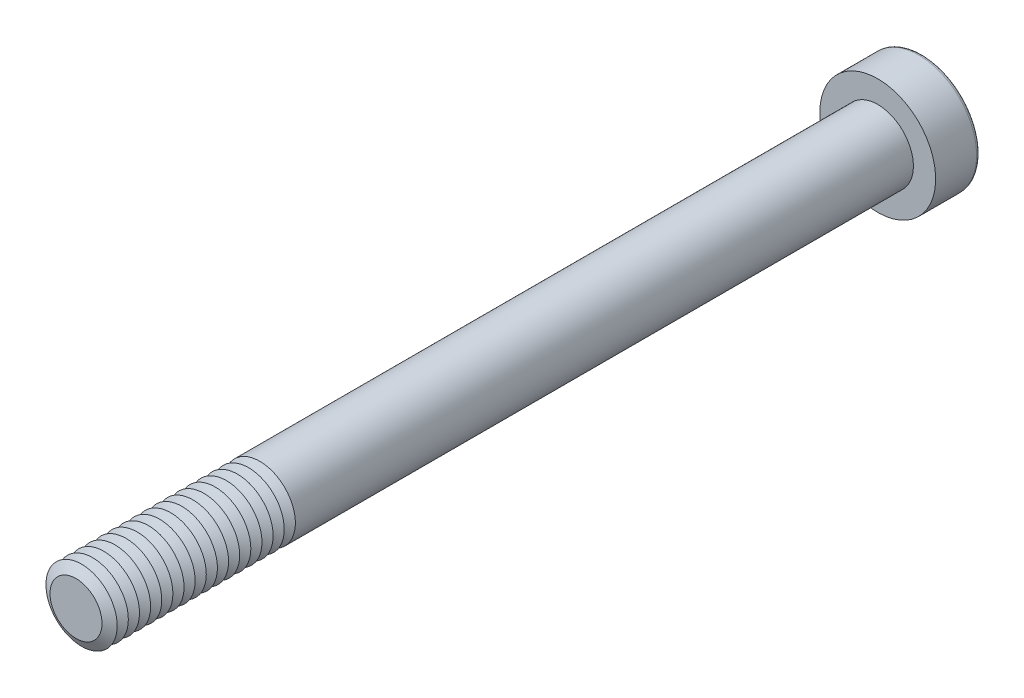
ISO-10303-21;
HEADER;
FILE_DESCRIPTION(('STEP AP214'),'2;1');
FILE_NAME('part.step','',(''),(''),'','','');
FILE_SCHEMA(('AUTOMOTIVE_DESIGN { 1 0 10303 214 1 1 1 1 }'));
ENDSEC;
DATA;
#1=APPLICATION_CONTEXT('core data for automotive mechanical design processes');
#2=APPLICATION_PROTOCOL_DEFINITION('international standard','automotive_design',2000,#1);
#3=PRODUCT_CONTEXT('',#1,'mechanical');
#4=PRODUCT('Part','Part','',(#3));
#5=PRODUCT_RELATED_PRODUCT_CATEGORY('part','',(#4));
#6=PRODUCT_DEFINITION_FORMATION('','',#4);
#7=PRODUCT_DEFINITION_CONTEXT('part definition',#1,'design');
#8=PRODUCT_DEFINITION('design','',#6,#7);
#9=PRODUCT_DEFINITION_SHAPE('','',#8);
#10=(LENGTH_UNIT() NAMED_UNIT(*) SI_UNIT(.MILLI.,.METRE.));
#11=(NAMED_UNIT(*) PLANE_ANGLE_UNIT() SI_UNIT($,.RADIAN.));
#12=(NAMED_UNIT(*) SI_UNIT($,.STERADIAN.) SOLID_ANGLE_UNIT());
#13=UNCERTAINTY_MEASURE_WITH_UNIT(LENGTH_MEASURE(1.E-05),#10,'distance_accuracy_value','');
#14=(GEOMETRIC_REPRESENTATION_CONTEXT(3) GLOBAL_UNCERTAINTY_ASSIGNED_CONTEXT((#13)) GLOBAL_UNIT_ASSIGNED_CONTEXT((#10,
#11,#12)) REPRESENTATION_CONTEXT('',''));
#15=CARTESIAN_POINT('',(0.,0.,0.));
#16=DIRECTION('',(0.,0.,1.));
#17=DIRECTION('',(1.,0.,0.));
#18=AXIS2_PLACEMENT_3D('',#15,#16,#17);
#19=CARTESIAN_POINT('',(0.,0.,85.625));
#20=DIRECTION('',(0.,0.,1.));
#21=DIRECTION('',(1.,0.,0.));
#22=AXIS2_PLACEMENT_3D('',#19,#20,#21);
#23=CONICAL_SURFACE('',#22,4.,1.0471975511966);
#24=CARTESIAN_POINT('',(0.,0.,85.));
#25=DIRECTION('',(0.,0.,1.));
#26=DIRECTION('',(1.,0.,0.));
#27=AXIS2_PLACEMENT_3D('',#24,#25,#26);
#28=CIRCLE('',#27,2.91746824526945);
#29=CARTESIAN_POINT('',(2.91746824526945,0.,85.));
#30=VERTEX_POINT('',#29);
#31=EDGE_CURVE('E312',#30,#30,#28,.T.);
#32=ORIENTED_EDGE('',*,*,#31,.T.);
#33=EDGE_LOOP('',(#32));
#34=FACE_BOUND('',#33,.T.);
#35=CARTESIAN_POINT('',(0.,0.,85.625));
#36=DIRECTION('',(0.,0.,1.));
#37=DIRECTION('',(1.,0.,0.));
#38=AXIS2_PLACEMENT_3D('',#35,#36,#37);
#39=CIRCLE('',#38,4.);
#40=CARTESIAN_POINT('',(4.,0.,85.625));
#41=VERTEX_POINT('',#40);
#42=EDGE_CURVE('E315',#41,#41,#39,.T.);
#43=ORIENTED_EDGE('',*,*,#42,.F.);
#44=EDGE_LOOP('',(#43));
#45=FACE_BOUND('',#44,.T.);
#46=ADVANCED_FACE('F39',(#34,#45),#23,.T.);
#47=CARTESIAN_POINT('',(0.,0.,85.));
#48=DIRECTION('',(0.,0.,-1.));
#49=DIRECTION('',(-1.,0.,0.));
#50=AXIS2_PLACEMENT_3D('',#47,#48,#49);
#51=CONICAL_SURFACE('',#50,2.91746824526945,1.0471975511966);
#52=CARTESIAN_POINT('',(0.,0.,84.375));
#53=DIRECTION('',(0.,0.,1.));
#54=DIRECTION('',(1.,0.,0.));
#55=AXIS2_PLACEMENT_3D('',#52,#53,#54);
#56=CIRCLE('',#55,4.);
#57=CARTESIAN_POINT('',(4.,0.,84.375));
#58=VERTEX_POINT('',#57);
#59=EDGE_CURVE('E323',#58,#58,#56,.T.);
#60=ORIENTED_EDGE('',*,*,#59,.T.);
#61=EDGE_LOOP('',(#60));
#62=FACE_BOUND('',#61,.T.);
#63=ORIENTED_EDGE('',*,*,#31,.F.);
#64=EDGE_LOOP('',(#63));
#65=FACE_BOUND('',#64,.T.);
#66=ADVANCED_FACE('F245',(#62,#65),#51,.T.);
#67=CARTESIAN_POINT('',(0.,0.,90.));
#68=DIRECTION('',(0.,0.,1.));
#69=DIRECTION('',(1.,0.,0.));
#70=AXIS2_PLACEMENT_3D('',#67,#68,#69);
#71=PLANE('',#70);
#72=CARTESIAN_POINT('',(0.,0.,90.));
#73=DIRECTION('',(0.,0.,1.));
#74=DIRECTION('',(1.,0.,0.));
#75=AXIS2_PLACEMENT_3D('',#72,#73,#74);
#76=CIRCLE('',#75,2.91746824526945);
#77=CARTESIAN_POINT('',(2.91746824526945,0.,90.));
#78=VERTEX_POINT('',#77);
#79=EDGE_CURVE('E174',#78,#78,#76,.T.);
#80=ORIENTED_EDGE('',*,*,#79,.T.);
#81=EDGE_LOOP('',(#80));
#82=FACE_BOUND('',#81,.T.);
#83=ADVANCED_FACE('F251',(#82),#71,.T.);
#84=CARTESIAN_POINT('',(0.,0.,90.));
#85=DIRECTION('',(0.,0.,-1.));
#86=DIRECTION('',(-1.,0.,0.));
#87=AXIS2_PLACEMENT_3D('',#84,#85,#86);
#88=CONICAL_SURFACE('',#87,2.91746824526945,1.0471975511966);
#89=CARTESIAN_POINT('',(0.,0.,89.375));
#90=DIRECTION('',(0.,0.,1.));
#91=DIRECTION('',(1.,0.,0.));
#92=AXIS2_PLACEMENT_3D('',#89,#90,#91);
#93=CIRCLE('',#92,4.);
#94=CARTESIAN_POINT('',(4.,0.,89.375));
#95=VERTEX_POINT('',#94);
#96=EDGE_CURVE('E291',#95,#95,#93,.T.);
#97=ORIENTED_EDGE('',*,*,#96,.T.);
#98=EDGE_LOOP('',(#97));
#99=FACE_BOUND('',#98,.T.);
#100=ORIENTED_EDGE('',*,*,#79,.F.);
#101=EDGE_LOOP('',(#100));
#102=FACE_BOUND('',#101,.T.);
#103=ADVANCED_FACE('F199',(#99,#102),#88,.T.);
#104=CARTESIAN_POINT('',(0.,0.,89.375));
#105=DIRECTION('',(0.,0.,1.));
#106=DIRECTION('',(1.,0.,0.));
#107=AXIS2_PLACEMENT_3D('',#104,#105,#106);
#108=CONICAL_SURFACE('',#107,4.,1.0471975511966);
#109=CARTESIAN_POINT('',(0.,0.,88.75));
#110=DIRECTION('',(0.,0.,1.));
#111=DIRECTION('',(1.,0.,0.));
#112=AXIS2_PLACEMENT_3D('',#109,#110,#111);
#113=CIRCLE('',#112,2.91746824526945);
#114=CARTESIAN_POINT('',(2.91746824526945,0.,88.75));
#115=VERTEX_POINT('',#114);
#116=EDGE_CURVE('E288',#115,#115,#113,.T.);
#117=ORIENTED_EDGE('',*,*,#116,.T.);
#118=EDGE_LOOP('',(#117));
#119=FACE_BOUND('',#118,.T.);
#120=ORIENTED_EDGE('',*,*,#96,.F.);
#121=EDGE_LOOP('',(#120));
#122=FACE_BOUND('',#121,.T.);
#123=ADVANCED_FACE('F277',(#119,#122),#108,.T.);
#124=CARTESIAN_POINT('',(0.,0.,88.75));
#125=DIRECTION('',(0.,0.,-1.));
#126=DIRECTION('',(-1.,0.,0.));
#127=AXIS2_PLACEMENT_3D('',#124,#125,#126);
#128=CONICAL_SURFACE('',#127,2.91746824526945,1.0471975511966);
#129=CARTESIAN_POINT('',(0.,0.,88.125));
#130=DIRECTION('',(0.,0.,1.));
#131=DIRECTION('',(1.,0.,0.));
#132=AXIS2_PLACEMENT_3D('',#129,#130,#131);
#133=CIRCLE('',#132,4.);
#134=CARTESIAN_POINT('',(4.,0.,88.125));
#135=VERTEX_POINT('',#134);
#136=EDGE_CURVE('E299',#135,#135,#133,.T.);
#137=ORIENTED_EDGE('',*,*,#136,.T.);
#138=EDGE_LOOP('',(#137));
#139=FACE_BOUND('',#138,.T.);
#140=ORIENTED_EDGE('',*,*,#116,.F.);
#141=EDGE_LOOP('',(#140));
#142=FACE_BOUND('',#141,.T.);
#143=ADVANCED_FACE('F274',(#139,#142),#128,.T.);
#144=CARTESIAN_POINT('',(0.,0.,88.125));
#145=DIRECTION('',(0.,0.,1.));
#146=DIRECTION('',(1.,0.,0.));
#147=AXIS2_PLACEMENT_3D('',#144,#145,#146);
#148=CONICAL_SURFACE('',#147,4.,1.0471975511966);
#149=CARTESIAN_POINT('',(0.,0.,87.5));
#150=DIRECTION('',(0.,0.,1.));
#151=DIRECTION('',(1.,0.,0.));
#152=AXIS2_PLACEMENT_3D('',#149,#150,#151);
#153=CIRCLE('',#152,2.91746824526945);
#154=CARTESIAN_POINT('',(2.91746824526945,0.,87.5));
#155=VERTEX_POINT('',#154);
#156=EDGE_CURVE('E293',#155,#155,#153,.T.);
#157=ORIENTED_EDGE('',*,*,#156,.T.);
#158=EDGE_LOOP('',(#157));
#159=FACE_BOUND('',#158,.T.);
#160=ORIENTED_EDGE('',*,*,#136,.F.);
#161=EDGE_LOOP('',(#160));
#162=FACE_BOUND('',#161,.T.);
#163=ADVANCED_FACE('F270',(#159,#162),#148,.T.);
#164=CARTESIAN_POINT('',(0.,0.,87.5));
#165=DIRECTION('',(0.,0.,-1.));
#166=DIRECTION('',(-1.,0.,0.));
#167=AXIS2_PLACEMENT_3D('',#164,#165,#166);
#168=CONICAL_SURFACE('',#167,2.91746824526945,1.0471975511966);
#169=CARTESIAN_POINT('',(0.,0.,86.875));
#170=DIRECTION('',(0.,0.,1.));
#171=DIRECTION('',(1.,0.,0.));
#172=AXIS2_PLACEMENT_3D('',#169,#170,#171);
#173=CIRCLE('',#172,4.);
#174=CARTESIAN_POINT('',(4.,0.,86.875));
#175=VERTEX_POINT('',#174);
#176=EDGE_CURVE('E309',#175,#175,#173,.T.);
#177=ORIENTED_EDGE('',*,*,#176,.T.);
#178=EDGE_LOOP('',(#177));
#179=FACE_BOUND('',#178,.T.);
#180=ORIENTED_EDGE('',*,*,#156,.F.);
#181=EDGE_LOOP('',(#180));
#182=FACE_BOUND('',#181,.T.);
#183=ADVANCED_FACE('F266',(#179,#182),#168,.T.);
#184=CARTESIAN_POINT('',(0.,0.,86.875));
#185=DIRECTION('',(0.,0.,1.));
#186=DIRECTION('',(1.,0.,0.));
#187=AXIS2_PLACEMENT_3D('',#184,#185,#186);
#188=CONICAL_SURFACE('',#187,4.,1.0471975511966);
#189=CARTESIAN_POINT('',(0.,0.,86.25));
#190=DIRECTION('',(0.,0.,1.));
#191=DIRECTION('',(1.,0.,0.));
#192=AXIS2_PLACEMENT_3D('',#189,#190,#191);
#193=CIRCLE('',#192,2.91746824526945);
#194=CARTESIAN_POINT('',(2.91746824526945,0.,86.25));
#195=VERTEX_POINT('',#194);
#196=EDGE_CURVE('E305',#195,#195,#193,.T.);
#197=ORIENTED_EDGE('',*,*,#196,.T.);
#198=EDGE_LOOP('',(#197));
#199=FACE_BOUND('',#198,.T.);
#200=ORIENTED_EDGE('',*,*,#176,.F.);
#201=EDGE_LOOP('',(#200));
#202=FACE_BOUND('',#201,.T.);
#203=ADVANCED_FACE('F262',(#199,#202),#188,.T.);
#204=CARTESIAN_POINT('',(0.,0.,86.25));
#205=DIRECTION('',(0.,0.,-1.));
#206=DIRECTION('',(-1.,0.,0.));
#207=AXIS2_PLACEMENT_3D('',#204,#205,#206);
#208=CONICAL_SURFACE('',#207,2.91746824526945,1.0471975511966);
#209=ORIENTED_EDGE('',*,*,#42,.T.);
#210=EDGE_LOOP('',(#209));
#211=FACE_BOUND('',#210,.T.);
#212=ORIENTED_EDGE('',*,*,#196,.F.);
#213=EDGE_LOOP('',(#212));
#214=FACE_BOUND('',#213,.T.);
#215=ADVANCED_FACE('F258',(#211,#214),#208,.T.);
#216=CARTESIAN_POINT('',(0.,0.,84.375));
#217=DIRECTION('',(0.,0.,1.));
#218=DIRECTION('',(1.,0.,0.));
#219=AXIS2_PLACEMENT_3D('',#216,#217,#218);
#220=CONICAL_SURFACE('',#219,4.,1.0471975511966);
#221=CARTESIAN_POINT('',(0.,0.,83.75));
#222=DIRECTION('',(0.,0.,1.));
#223=DIRECTION('',(1.,0.,0.));
#224=AXIS2_PLACEMENT_3D('',#221,#222,#223);
#225=CIRCLE('',#224,2.91746824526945);
#226=CARTESIAN_POINT('',(2.91746824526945,0.,83.75));
#227=VERTEX_POINT('',#226);
#228=EDGE_CURVE('E319',#227,#227,#225,.T.);
#229=ORIENTED_EDGE('',*,*,#228,.T.);
#230=EDGE_LOOP('',(#229));
#231=FACE_BOUND('',#230,.T.);
#232=ORIENTED_EDGE('',*,*,#59,.F.);
#233=EDGE_LOOP('',(#232));
#234=FACE_BOUND('',#233,.T.);
#235=ADVANCED_FACE('F261',(#231,#234),#220,.T.);
#236=CARTESIAN_POINT('',(0.,0.,83.75));
#237=DIRECTION('',(0.,0.,-1.));
#238=DIRECTION('',(-1.,0.,0.));
#239=AXIS2_PLACEMENT_3D('',#236,#237,#238);
#240=CONICAL_SURFACE('',#239,2.91746824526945,1.0471975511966);
#241=CARTESIAN_POINT('',(0.,0.,83.125));
#242=DIRECTION('',(0.,0.,1.));
#243=DIRECTION('',(1.,0.,0.));
#244=AXIS2_PLACEMENT_3D('',#241,#242,#243);
#245=CIRCLE('',#244,4.);
#246=CARTESIAN_POINT('',(4.,0.,83.125));
#247=VERTEX_POINT('',#246);
#248=EDGE_CURVE('E331',#247,#247,#245,.T.);
#249=ORIENTED_EDGE('',*,*,#248,.T.);
#250=EDGE_LOOP('',(#249));
#251=FACE_BOUND('',#250,.T.);
#252=ORIENTED_EDGE('',*,*,#228,.F.);
#253=EDGE_LOOP('',(#252));
#254=FACE_BOUND('',#253,.T.);
#255=ADVANCED_FACE('F512',(#251,#254),#240,.T.);
#256=CARTESIAN_POINT('',(0.,0.,83.125));
#257=DIRECTION('',(0.,0.,1.));
#258=DIRECTION('',(1.,0.,0.));
#259=AXIS2_PLACEMENT_3D('',#256,#257,#258);
#260=CONICAL_SURFACE('',#259,4.,1.0471975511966);
#261=CARTESIAN_POINT('',(0.,0.,82.5));
#262=DIRECTION('',(0.,0.,1.));
#263=DIRECTION('',(1.,0.,0.));
#264=AXIS2_PLACEMENT_3D('',#261,#262,#263);
#265=CIRCLE('',#264,2.91746824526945);
#266=CARTESIAN_POINT('',(2.91746824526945,0.,82.5));
#267=VERTEX_POINT('',#266);
#268=EDGE_CURVE('E327',#267,#267,#265,.T.);
#269=ORIENTED_EDGE('',*,*,#268,.T.);
#270=EDGE_LOOP('',(#269));
#271=FACE_BOUND('',#270,.T.);
#272=ORIENTED_EDGE('',*,*,#248,.F.);
#273=EDGE_LOOP('',(#272));
#274=FACE_BOUND('',#273,.T.);
#275=ADVANCED_FACE('F508',(#271,#274),#260,.T.);
#276=CARTESIAN_POINT('',(0.,0.,82.5));
#277=DIRECTION('',(0.,0.,-1.));
#278=DIRECTION('',(-1.,0.,0.));
#279=AXIS2_PLACEMENT_3D('',#276,#277,#278);
#280=CONICAL_SURFACE('',#279,2.91746824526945,1.0471975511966);
#281=CARTESIAN_POINT('',(0.,0.,81.875));
#282=DIRECTION('',(0.,0.,1.));
#283=DIRECTION('',(1.,0.,0.));
#284=AXIS2_PLACEMENT_3D('',#281,#282,#283);
#285=CIRCLE('',#284,4.);
#286=CARTESIAN_POINT('',(4.,0.,81.875));
#287=VERTEX_POINT('',#286);
#288=EDGE_CURVE('E339',#287,#287,#285,.T.);
#289=ORIENTED_EDGE('',*,*,#288,.T.);
#290=EDGE_LOOP('',(#289));
#291=FACE_BOUND('',#290,.T.);
#292=ORIENTED_EDGE('',*,*,#268,.F.);
#293=EDGE_LOOP('',(#292));
#294=FACE_BOUND('',#293,.T.);
#295=ADVANCED_FACE('F504',(#291,#294),#280,.T.);
#296=CARTESIAN_POINT('',(0.,0.,81.875));
#297=DIRECTION('',(0.,0.,1.));
#298=DIRECTION('',(1.,0.,0.));
#299=AXIS2_PLACEMENT_3D('',#296,#297,#298);
#300=CONICAL_SURFACE('',#299,4.,1.0471975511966);
#301=CARTESIAN_POINT('',(0.,0.,81.25));
#302=DIRECTION('',(0.,0.,1.));
#303=DIRECTION('',(1.,0.,0.));
#304=AXIS2_PLACEMENT_3D('',#301,#302,#303);
#305=CIRCLE('',#304,2.91746824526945);
#306=CARTESIAN_POINT('',(2.91746824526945,0.,81.25));
#307=VERTEX_POINT('',#306);
#308=EDGE_CURVE('E335',#307,#307,#305,.T.);
#309=ORIENTED_EDGE('',*,*,#308,.T.);
#310=EDGE_LOOP('',(#309));
#311=FACE_BOUND('',#310,.T.);
#312=ORIENTED_EDGE('',*,*,#288,.F.);
#313=EDGE_LOOP('',(#312));
#314=FACE_BOUND('',#313,.T.);
#315=ADVANCED_FACE('F500',(#311,#314),#300,.T.);
#316=CARTESIAN_POINT('',(0.,0.,81.25));
#317=DIRECTION('',(0.,0.,-1.));
#318=DIRECTION('',(-1.,0.,0.));
#319=AXIS2_PLACEMENT_3D('',#316,#317,#318);
#320=CONICAL_SURFACE('',#319,2.91746824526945,1.0471975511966);
#321=CARTESIAN_POINT('',(0.,0.,80.625));
#322=DIRECTION('',(0.,0.,1.));
#323=DIRECTION('',(1.,0.,0.));
#324=AXIS2_PLACEMENT_3D('',#321,#322,#323);
#325=CIRCLE('',#324,4.);
#326=CARTESIAN_POINT('',(4.,0.,80.625));
#327=VERTEX_POINT('',#326);
#328=EDGE_CURVE('E347',#327,#327,#325,.T.);
#329=ORIENTED_EDGE('',*,*,#328,.T.);
#330=EDGE_LOOP('',(#329));
#331=FACE_BOUND('',#330,.T.);
#332=ORIENTED_EDGE('',*,*,#308,.F.);
#333=EDGE_LOOP('',(#332));
#334=FACE_BOUND('',#333,.T.);
#335=ADVANCED_FACE('F496',(#331,#334),#320,.T.);
#336=CARTESIAN_POINT('',(0.,0.,80.625));
#337=DIRECTION('',(0.,0.,1.));
#338=DIRECTION('',(1.,0.,0.));
#339=AXIS2_PLACEMENT_3D('',#336,#337,#338);
#340=CONICAL_SURFACE('',#339,4.,1.0471975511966);
#341=CARTESIAN_POINT('',(0.,0.,80.));
#342=DIRECTION('',(0.,0.,1.));
#343=DIRECTION('',(1.,0.,0.));
#344=AXIS2_PLACEMENT_3D('',#341,#342,#343);
#345=CIRCLE('',#344,2.91746824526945);
#346=CARTESIAN_POINT('',(2.91746824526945,0.,80.));
#347=VERTEX_POINT('',#346);
#348=EDGE_CURVE('E343',#347,#347,#345,.T.);
#349=ORIENTED_EDGE('',*,*,#348,.T.);
#350=EDGE_LOOP('',(#349));
#351=FACE_BOUND('',#350,.T.);
#352=ORIENTED_EDGE('',*,*,#328,.F.);
#353=EDGE_LOOP('',(#352));
#354=FACE_BOUND('',#353,.T.);
#355=ADVANCED_FACE('F492',(#351,#354),#340,.T.);
#356=CARTESIAN_POINT('',(0.,0.,80.));
#357=DIRECTION('',(0.,0.,-1.));
#358=DIRECTION('',(-1.,0.,0.));
#359=AXIS2_PLACEMENT_3D('',#356,#357,#358);
#360=CONICAL_SURFACE('',#359,2.91746824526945,1.0471975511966);
#361=CARTESIAN_POINT('',(0.,0.,79.375));
#362=DIRECTION('',(0.,0.,1.));
#363=DIRECTION('',(1.,0.,0.));
#364=AXIS2_PLACEMENT_3D('',#361,#362,#363);
#365=CIRCLE('',#364,4.);
#366=CARTESIAN_POINT('',(4.,0.,79.375));
#367=VERTEX_POINT('',#366);
#368=EDGE_CURVE('E355',#367,#367,#365,.T.);
#369=ORIENTED_EDGE('',*,*,#368,.T.);
#370=EDGE_LOOP('',(#369));
#371=FACE_BOUND('',#370,.T.);
#372=ORIENTED_EDGE('',*,*,#348,.F.);
#373=EDGE_LOOP('',(#372));
#374=FACE_BOUND('',#373,.T.);
#375=ADVANCED_FACE('F488',(#371,#374),#360,.T.);
#376=CARTESIAN_POINT('',(0.,0.,79.375));
#377=DIRECTION('',(0.,0.,1.));
#378=DIRECTION('',(1.,0.,0.));
#379=AXIS2_PLACEMENT_3D('',#376,#377,#378);
#380=CONICAL_SURFACE('',#379,4.,1.0471975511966);
#381=CARTESIAN_POINT('',(0.,0.,78.75));
#382=DIRECTION('',(0.,0.,1.));
#383=DIRECTION('',(1.,0.,0.));
#384=AXIS2_PLACEMENT_3D('',#381,#382,#383);
#385=CIRCLE('',#384,2.91746824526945);
#386=CARTESIAN_POINT('',(2.91746824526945,0.,78.75));
#387=VERTEX_POINT('',#386);
#388=EDGE_CURVE('E351',#387,#387,#385,.T.);
#389=ORIENTED_EDGE('',*,*,#388,.T.);
#390=EDGE_LOOP('',(#389));
#391=FACE_BOUND('',#390,.T.);
#392=ORIENTED_EDGE('',*,*,#368,.F.);
#393=EDGE_LOOP('',(#392));
#394=FACE_BOUND('',#393,.T.);
#395=ADVANCED_FACE('F484',(#391,#394),#380,.T.);
#396=CARTESIAN_POINT('',(0.,0.,78.75));
#397=DIRECTION('',(0.,0.,-1.));
#398=DIRECTION('',(-1.,0.,0.));
#399=AXIS2_PLACEMENT_3D('',#396,#397,#398);
#400=CONICAL_SURFACE('',#399,2.91746824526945,1.0471975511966);
#401=CARTESIAN_POINT('',(0.,0.,78.125));
#402=DIRECTION('',(0.,0.,1.));
#403=DIRECTION('',(1.,0.,0.));
#404=AXIS2_PLACEMENT_3D('',#401,#402,#403);
#405=CIRCLE('',#404,4.);
#406=CARTESIAN_POINT('',(4.,0.,78.125));
#407=VERTEX_POINT('',#406);
#408=EDGE_CURVE('E363',#407,#407,#405,.T.);
#409=ORIENTED_EDGE('',*,*,#408,.T.);
#410=EDGE_LOOP('',(#409));
#411=FACE_BOUND('',#410,.T.);
#412=ORIENTED_EDGE('',*,*,#388,.F.);
#413=EDGE_LOOP('',(#412));
#414=FACE_BOUND('',#413,.T.);
#415=ADVANCED_FACE('F480',(#411,#414),#400,.T.);
#416=CARTESIAN_POINT('',(0.,0.,78.125));
#417=DIRECTION('',(0.,0.,1.));
#418=DIRECTION('',(1.,0.,0.));
#419=AXIS2_PLACEMENT_3D('',#416,#417,#418);
#420=CONICAL_SURFACE('',#419,4.,1.0471975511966);
#421=CARTESIAN_POINT('',(0.,0.,77.5));
#422=DIRECTION('',(0.,0.,1.));
#423=DIRECTION('',(1.,0.,0.));
#424=AXIS2_PLACEMENT_3D('',#421,#422,#423);
#425=CIRCLE('',#424,2.91746824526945);
#426=CARTESIAN_POINT('',(2.91746824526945,0.,77.5));
#427=VERTEX_POINT('',#426);
#428=EDGE_CURVE('E359',#427,#427,#425,.T.);
#429=ORIENTED_EDGE('',*,*,#428,.T.);
#430=EDGE_LOOP('',(#429));
#431=FACE_BOUND('',#430,.T.);
#432=ORIENTED_EDGE('',*,*,#408,.F.);
#433=EDGE_LOOP('',(#432));
#434=FACE_BOUND('',#433,.T.);
#435=ADVANCED_FACE('F476',(#431,#434),#420,.T.);
#436=CARTESIAN_POINT('',(0.,0.,77.5));
#437=DIRECTION('',(0.,0.,-1.));
#438=DIRECTION('',(-1.,0.,0.));
#439=AXIS2_PLACEMENT_3D('',#436,#437,#438);
#440=CONICAL_SURFACE('',#439,2.91746824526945,1.0471975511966);
#441=CARTESIAN_POINT('',(0.,0.,76.875));
#442=DIRECTION('',(0.,0.,1.));
#443=DIRECTION('',(1.,0.,0.));
#444=AXIS2_PLACEMENT_3D('',#441,#442,#443);
#445=CIRCLE('',#444,4.);
#446=CARTESIAN_POINT('',(4.,0.,76.875));
#447=VERTEX_POINT('',#446);
#448=EDGE_CURVE('E371',#447,#447,#445,.T.);
#449=ORIENTED_EDGE('',*,*,#448,.T.);
#450=EDGE_LOOP('',(#449));
#451=FACE_BOUND('',#450,.T.);
#452=ORIENTED_EDGE('',*,*,#428,.F.);
#453=EDGE_LOOP('',(#452));
#454=FACE_BOUND('',#453,.T.);
#455=ADVANCED_FACE('F472',(#451,#454),#440,.T.);
#456=CARTESIAN_POINT('',(0.,0.,76.875));
#457=DIRECTION('',(0.,0.,1.));
#458=DIRECTION('',(1.,0.,0.));
#459=AXIS2_PLACEMENT_3D('',#456,#457,#458);
#460=CONICAL_SURFACE('',#459,4.,1.0471975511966);
#461=CARTESIAN_POINT('',(0.,0.,76.25));
#462=DIRECTION('',(0.,0.,1.));
#463=DIRECTION('',(1.,0.,0.));
#464=AXIS2_PLACEMENT_3D('',#461,#462,#463);
#465=CIRCLE('',#464,2.91746824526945);
#466=CARTESIAN_POINT('',(2.91746824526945,0.,76.25));
#467=VERTEX_POINT('',#466);
#468=EDGE_CURVE('E367',#467,#467,#465,.T.);
#469=ORIENTED_EDGE('',*,*,#468,.T.);
#470=EDGE_LOOP('',(#469));
#471=FACE_BOUND('',#470,.T.);
#472=ORIENTED_EDGE('',*,*,#448,.F.);
#473=EDGE_LOOP('',(#472));
#474=FACE_BOUND('',#473,.T.);
#475=ADVANCED_FACE('F468',(#471,#474),#460,.T.);
#476=CARTESIAN_POINT('',(0.,0.,76.25));
#477=DIRECTION('',(0.,0.,-1.));
#478=DIRECTION('',(-1.,0.,0.));
#479=AXIS2_PLACEMENT_3D('',#476,#477,#478);
#480=CONICAL_SURFACE('',#479,2.91746824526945,1.0471975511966);
#481=CARTESIAN_POINT('',(0.,0.,75.625));
#482=DIRECTION('',(0.,0.,1.));
#483=DIRECTION('',(1.,0.,0.));
#484=AXIS2_PLACEMENT_3D('',#481,#482,#483);
#485=CIRCLE('',#484,4.);
#486=CARTESIAN_POINT('',(4.,0.,75.625));
#487=VERTEX_POINT('',#486);
#488=EDGE_CURVE('E379',#487,#487,#485,.T.);
#489=ORIENTED_EDGE('',*,*,#488,.T.);
#490=EDGE_LOOP('',(#489));
#491=FACE_BOUND('',#490,.T.);
#492=ORIENTED_EDGE('',*,*,#468,.F.);
#493=EDGE_LOOP('',(#492));
#494=FACE_BOUND('',#493,.T.);
#495=ADVANCED_FACE('F464',(#491,#494),#480,.T.);
#496=CARTESIAN_POINT('',(0.,0.,75.625));
#497=DIRECTION('',(0.,0.,1.));
#498=DIRECTION('',(1.,0.,0.));
#499=AXIS2_PLACEMENT_3D('',#496,#497,#498);
#500=CONICAL_SURFACE('',#499,4.,1.0471975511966);
#501=CARTESIAN_POINT('',(0.,0.,75.));
#502=DIRECTION('',(0.,0.,1.));
#503=DIRECTION('',(1.,0.,0.));
#504=AXIS2_PLACEMENT_3D('',#501,#502,#503);
#505=CIRCLE('',#504,2.91746824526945);
#506=CARTESIAN_POINT('',(2.91746824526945,0.,75.));
#507=VERTEX_POINT('',#506);
#508=EDGE_CURVE('E375',#507,#507,#505,.T.);
#509=ORIENTED_EDGE('',*,*,#508,.T.);
#510=EDGE_LOOP('',(#509));
#511=FACE_BOUND('',#510,.T.);
#512=ORIENTED_EDGE('',*,*,#488,.F.);
#513=EDGE_LOOP('',(#512));
#514=FACE_BOUND('',#513,.T.);
#515=ADVANCED_FACE('F460',(#511,#514),#500,.T.);
#516=CARTESIAN_POINT('',(0.,0.,75.));
#517=DIRECTION('',(0.,0.,-1.));
#518=DIRECTION('',(-1.,0.,0.));
#519=AXIS2_PLACEMENT_3D('',#516,#517,#518);
#520=CONICAL_SURFACE('',#519,2.91746824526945,1.0471975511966);
#521=CARTESIAN_POINT('',(0.,0.,74.375));
#522=DIRECTION('',(0.,0.,1.));
#523=DIRECTION('',(1.,0.,0.));
#524=AXIS2_PLACEMENT_3D('',#521,#522,#523);
#525=CIRCLE('',#524,4.);
#526=CARTESIAN_POINT('',(4.,0.,74.375));
#527=VERTEX_POINT('',#526);
#528=EDGE_CURVE('E387',#527,#527,#525,.T.);
#529=ORIENTED_EDGE('',*,*,#528,.T.);
#530=EDGE_LOOP('',(#529));
#531=FACE_BOUND('',#530,.T.);
#532=ORIENTED_EDGE('',*,*,#508,.F.);
#533=EDGE_LOOP('',(#532));
#534=FACE_BOUND('',#533,.T.);
#535=ADVANCED_FACE('F456',(#531,#534),#520,.T.);
#536=CARTESIAN_POINT('',(0.,0.,74.375));
#537=DIRECTION('',(0.,0.,1.));
#538=DIRECTION('',(1.,0.,0.));
#539=AXIS2_PLACEMENT_3D('',#536,#537,#538);
#540=CONICAL_SURFACE('',#539,4.,1.0471975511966);
#541=CARTESIAN_POINT('',(0.,0.,73.75));
#542=DIRECTION('',(0.,0.,1.));
#543=DIRECTION('',(1.,0.,0.));
#544=AXIS2_PLACEMENT_3D('',#541,#542,#543);
#545=CIRCLE('',#544,2.91746824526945);
#546=CARTESIAN_POINT('',(2.91746824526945,0.,73.75));
#547=VERTEX_POINT('',#546);
#548=EDGE_CURVE('E383',#547,#547,#545,.T.);
#549=ORIENTED_EDGE('',*,*,#548,.T.);
#550=EDGE_LOOP('',(#549));
#551=FACE_BOUND('',#550,.T.);
#552=ORIENTED_EDGE('',*,*,#528,.F.);
#553=EDGE_LOOP('',(#552));
#554=FACE_BOUND('',#553,.T.);
#555=ADVANCED_FACE('F452',(#551,#554),#540,.T.);
#556=CARTESIAN_POINT('',(0.,0.,73.75));
#557=DIRECTION('',(0.,0.,-1.));
#558=DIRECTION('',(-1.,0.,0.));
#559=AXIS2_PLACEMENT_3D('',#556,#557,#558);
#560=CONICAL_SURFACE('',#559,2.91746824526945,1.0471975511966);
#561=CARTESIAN_POINT('',(0.,0.,73.125));
#562=DIRECTION('',(0.,0.,1.));
#563=DIRECTION('',(1.,0.,0.));
#564=AXIS2_PLACEMENT_3D('',#561,#562,#563);
#565=CIRCLE('',#564,4.);
#566=CARTESIAN_POINT('',(4.,0.,73.125));
#567=VERTEX_POINT('',#566);
#568=EDGE_CURVE('E395',#567,#567,#565,.T.);
#569=ORIENTED_EDGE('',*,*,#568,.T.);
#570=EDGE_LOOP('',(#569));
#571=FACE_BOUND('',#570,.T.);
#572=ORIENTED_EDGE('',*,*,#548,.F.);
#573=EDGE_LOOP('',(#572));
#574=FACE_BOUND('',#573,.T.);
#575=ADVANCED_FACE('F448',(#571,#574),#560,.T.);
#576=CARTESIAN_POINT('',(0.,0.,73.125));
#577=DIRECTION('',(0.,0.,1.));
#578=DIRECTION('',(1.,0.,0.));
#579=AXIS2_PLACEMENT_3D('',#576,#577,#578);
#580=CONICAL_SURFACE('',#579,4.,1.0471975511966);
#581=CARTESIAN_POINT('',(0.,0.,72.5));
#582=DIRECTION('',(0.,0.,1.));
#583=DIRECTION('',(1.,0.,0.));
#584=AXIS2_PLACEMENT_3D('',#581,#582,#583);
#585=CIRCLE('',#584,2.91746824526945);
#586=CARTESIAN_POINT('',(2.91746824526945,0.,72.5));
#587=VERTEX_POINT('',#586);
#588=EDGE_CURVE('E391',#587,#587,#585,.T.);
#589=ORIENTED_EDGE('',*,*,#588,.T.);
#590=EDGE_LOOP('',(#589));
#591=FACE_BOUND('',#590,.T.);
#592=ORIENTED_EDGE('',*,*,#568,.F.);
#593=EDGE_LOOP('',(#592));
#594=FACE_BOUND('',#593,.T.);
#595=ADVANCED_FACE('F444',(#591,#594),#580,.T.);
#596=CARTESIAN_POINT('',(0.,0.,72.5));
#597=DIRECTION('',(0.,0.,-1.));
#598=DIRECTION('',(-1.,0.,0.));
#599=AXIS2_PLACEMENT_3D('',#596,#597,#598);
#600=CONICAL_SURFACE('',#599,2.91746824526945,1.0471975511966);
#601=CARTESIAN_POINT('',(0.,0.,71.875));
#602=DIRECTION('',(0.,0.,1.));
#603=DIRECTION('',(1.,0.,0.));
#604=AXIS2_PLACEMENT_3D('',#601,#602,#603);
#605=CIRCLE('',#604,4.);
#606=CARTESIAN_POINT('',(4.,0.,71.875));
#607=VERTEX_POINT('',#606);
#608=EDGE_CURVE('E403',#607,#607,#605,.T.);
#609=ORIENTED_EDGE('',*,*,#608,.T.);
#610=EDGE_LOOP('',(#609));
#611=FACE_BOUND('',#610,.T.);
#612=ORIENTED_EDGE('',*,*,#588,.F.);
#613=EDGE_LOOP('',(#612));
#614=FACE_BOUND('',#613,.T.);
#615=ADVANCED_FACE('F440',(#611,#614),#600,.T.);
#616=CARTESIAN_POINT('',(0.,0.,71.875));
#617=DIRECTION('',(0.,0.,1.));
#618=DIRECTION('',(1.,0.,0.));
#619=AXIS2_PLACEMENT_3D('',#616,#617,#618);
#620=CONICAL_SURFACE('',#619,4.,1.0471975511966);
#621=CARTESIAN_POINT('',(0.,0.,71.25));
#622=DIRECTION('',(0.,0.,1.));
#623=DIRECTION('',(1.,0.,0.));
#624=AXIS2_PLACEMENT_3D('',#621,#622,#623);
#625=CIRCLE('',#624,2.91746824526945);
#626=CARTESIAN_POINT('',(2.91746824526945,0.,71.25));
#627=VERTEX_POINT('',#626);
#628=EDGE_CURVE('E399',#627,#627,#625,.T.);
#629=ORIENTED_EDGE('',*,*,#628,.T.);
#630=EDGE_LOOP('',(#629));
#631=FACE_BOUND('',#630,.T.);
#632=ORIENTED_EDGE('',*,*,#608,.F.);
#633=EDGE_LOOP('',(#632));
#634=FACE_BOUND('',#633,.T.);
#635=ADVANCED_FACE('F435',(#631,#634),#620,.T.);
#636=CARTESIAN_POINT('',(0.,0.,71.25));
#637=DIRECTION('',(0.,0.,-1.));
#638=DIRECTION('',(-1.,0.,0.));
#639=AXIS2_PLACEMENT_3D('',#636,#637,#638);
#640=CONICAL_SURFACE('',#639,2.91746824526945,1.0471975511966);
#641=CARTESIAN_POINT('',(0.,0.,70.625));
#642=DIRECTION('',(0.,0.,1.));
#643=DIRECTION('',(1.,0.,0.));
#644=AXIS2_PLACEMENT_3D('',#641,#642,#643);
#645=CIRCLE('',#644,4.);
#646=CARTESIAN_POINT('',(4.,0.,70.625));
#647=VERTEX_POINT('',#646);
#648=EDGE_CURVE('E415',#647,#647,#645,.T.);
#649=ORIENTED_EDGE('',*,*,#648,.T.);
#650=EDGE_LOOP('',(#649));
#651=FACE_BOUND('',#650,.T.);
#652=ORIENTED_EDGE('',*,*,#628,.F.);
#653=EDGE_LOOP('',(#652));
#654=FACE_BOUND('',#653,.T.);
#655=ADVANCED_FACE('F421',(#651,#654),#640,.T.);
#656=CARTESIAN_POINT('',(0.,0.,70.625));
#657=DIRECTION('',(0.,0.,1.));
#658=DIRECTION('',(1.,0.,0.));
#659=AXIS2_PLACEMENT_3D('',#656,#657,#658);
#660=CONICAL_SURFACE('',#659,4.,1.0471975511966);
#661=CARTESIAN_POINT('',(0.,0.,70.));
#662=DIRECTION('',(0.,0.,1.));
#663=DIRECTION('',(1.,0.,0.));
#664=AXIS2_PLACEMENT_3D('',#661,#662,#663);
#665=CIRCLE('',#664,2.91746824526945);
#666=CARTESIAN_POINT('',(2.91746824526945,0.,70.));
#667=VERTEX_POINT('',#666);
#668=EDGE_CURVE('E407',#667,#667,#665,.T.);
#669=ORIENTED_EDGE('',*,*,#668,.T.);
#670=EDGE_LOOP('',(#669));
#671=FACE_BOUND('',#670,.T.);
#672=ORIENTED_EDGE('',*,*,#648,.F.);
#673=EDGE_LOOP('',(#672));
#674=FACE_BOUND('',#673,.T.);
#675=ADVANCED_FACE('F424',(#671,#674),#660,.T.);
#676=CARTESIAN_POINT('',(0.,0.,70.));
#677=DIRECTION('',(0.,0.,-1.));
#678=DIRECTION('',(-1.,0.,0.));
#679=AXIS2_PLACEMENT_3D('',#676,#677,#678);
#680=CONICAL_SURFACE('',#679,2.91746824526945,1.0471975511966);
#681=CARTESIAN_POINT('',(0.,0.,69.375));
#682=DIRECTION('',(0.,0.,1.));
#683=DIRECTION('',(1.,0.,0.));
#684=AXIS2_PLACEMENT_3D('',#681,#682,#683);
#685=CIRCLE('',#684,4.);
#686=CARTESIAN_POINT('',(-4.,0.,69.375));
#687=VERTEX_POINT('',#686);
#688=EDGE_CURVE('E411',#687,#687,#685,.T.);
#689=ORIENTED_EDGE('',*,*,#688,.T.);
#690=EDGE_LOOP('',(#689));
#691=FACE_BOUND('',#690,.T.);
#692=ORIENTED_EDGE('',*,*,#668,.F.);
#693=EDGE_LOOP('',(#692));
#694=FACE_BOUND('',#693,.T.);
#695=ADVANCED_FACE('F426',(#691,#694),#680,.T.);
#696=CARTESIAN_POINT('',(0.,0.,-1.25));
#697=DIRECTION('',(0.,0.,-1.));
#698=DIRECTION('',(-1.,0.,0.));
#699=AXIS2_PLACEMENT_3D('',#696,#697,#698);
#700=CONICAL_SURFACE('',#699,2.5,1.0471975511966);
#701=CARTESIAN_POINT('',(0.,0.,0.193375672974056));
#702=VERTEX_POINT('',#701);
#703=VERTEX_LOOP('',#702);
#704=FACE_BOUND('',#703,.T.);
#705=CARTESIAN_POINT('',(0.,0.,-1.25));
#706=DIRECTION('',(0.,0.,-1.));
#707=DIRECTION('',(-1.,0.,0.));
#708=AXIS2_PLACEMENT_3D('',#705,#706,#707);
#709=CIRCLE('',#708,2.5);
#710=CARTESIAN_POINT('',(-2.1650635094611,1.25,-1.25));
#711=VERTEX_POINT('',#710);
#712=CARTESIAN_POINT('',(0.,2.5,-1.25));
#713=VERTEX_POINT('',#712);
#714=EDGE_CURVE('E149',#711,#713,#709,.T.);
#715=ORIENTED_EDGE('',*,*,#714,.T.);
#716=CARTESIAN_POINT('',(0.,0.,-1.25));
#717=DIRECTION('',(0.,0.,-1.));
#718=DIRECTION('',(-1.,0.,0.));
#719=AXIS2_PLACEMENT_3D('',#716,#717,#718);
#720=CIRCLE('',#719,2.5);
#721=CARTESIAN_POINT('',(2.1650635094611,1.25,-1.25));
#722=VERTEX_POINT('',#721);
#723=EDGE_CURVE('E54',#713,#722,#720,.T.);
#724=ORIENTED_EDGE('',*,*,#723,.T.);
#725=CARTESIAN_POINT('',(2.1650635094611,-1.25,-1.25));
#726=VERTEX_POINT('',#725);
#727=EDGE_CURVE('E1027',#722,#726,#720,.T.);
#728=ORIENTED_EDGE('',*,*,#727,.T.);
#729=CARTESIAN_POINT('',(0.,-2.5,-1.25));
#730=VERTEX_POINT('',#729);
#731=EDGE_CURVE('E1025',#726,#730,#720,.T.);
#732=ORIENTED_EDGE('',*,*,#731,.T.);
#733=CARTESIAN_POINT('',(-2.1650635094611,-1.25,-1.25));
#734=VERTEX_POINT('',#733);
#735=EDGE_CURVE('E1020',#730,#734,#720,.T.);
#736=ORIENTED_EDGE('',*,*,#735,.T.);
#737=EDGE_CURVE('E1018',#734,#711,#720,.T.);
#738=ORIENTED_EDGE('',*,*,#737,.T.);
#739=EDGE_LOOP('',(#715,#724,#728,#732,#736,#738));
#740=FACE_BOUND('',#739,.T.);
#741=ADVANCED_FACE('F201',(#704,#740),#700,.F.);
#742=CARTESIAN_POINT('',(0.,0.,-1.25));
#743=DIRECTION('',(0.,0.,-1.));
#744=DIRECTION('',(-1.,0.,0.));
#745=AXIS2_PLACEMENT_3D('',#742,#743,#744);
#746=PLANE('',#745);
#747=ORIENTED_EDGE('',*,*,#723,.F.);
#748=DIRECTION('',(1.,0.,0.));
#749=VECTOR('',#748,1.);
#750=CARTESIAN_POINT('',(-1.44337567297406,2.5,-1.25));
#751=LINE('',#750,#749);
#752=CARTESIAN_POINT('',(1.44337567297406,2.5,-1.25));
#753=VERTEX_POINT('',#752);
#754=EDGE_CURVE('E1066',#713,#753,#751,.T.);
#755=ORIENTED_EDGE('',*,*,#754,.T.);
#756=DIRECTION('',(0.5,-0.866025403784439,0.));
#757=VECTOR('',#756,1.);
#758=CARTESIAN_POINT('',(1.44337567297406,2.5,-1.25));
#759=LINE('',#758,#757);
#760=EDGE_CURVE('E155',#753,#722,#759,.T.);
#761=ORIENTED_EDGE('',*,*,#760,.T.);
#762=EDGE_LOOP('',(#747,#755,#761));
#763=FACE_BOUND('',#762,.T.);
#764=ADVANCED_FACE('F607',(#763),#746,.T.);
#765=ORIENTED_EDGE('',*,*,#727,.F.);
#766=CARTESIAN_POINT('',(2.88675134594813,0.,-1.25));
#767=VERTEX_POINT('',#766);
#768=EDGE_CURVE('E1070',#722,#767,#759,.T.);
#769=ORIENTED_EDGE('',*,*,#768,.T.);
#770=DIRECTION('',(-0.5,-0.866025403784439,0.));
#771=VECTOR('',#770,1.);
#772=CARTESIAN_POINT('',(2.88675134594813,0.,-1.25));
#773=LINE('',#772,#771);
#774=EDGE_CURVE('E1039',#767,#726,#773,.T.);
#775=ORIENTED_EDGE('',*,*,#774,.T.);
#776=EDGE_LOOP('',(#765,#769,#775));
#777=FACE_BOUND('',#776,.T.);
#778=ADVANCED_FACE('F617',(#777),#746,.T.);
#779=ORIENTED_EDGE('',*,*,#731,.F.);
#780=CARTESIAN_POINT('',(1.44337567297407,-2.5,-1.25));
#781=VERTEX_POINT('',#780);
#782=EDGE_CURVE('E1041',#726,#781,#773,.T.);
#783=ORIENTED_EDGE('',*,*,#782,.T.);
#784=DIRECTION('',(-1.,0.,0.));
#785=VECTOR('',#784,1.);
#786=CARTESIAN_POINT('',(1.44337567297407,-2.5,-1.25));
#787=LINE('',#786,#785);
#788=EDGE_CURVE('E994',#781,#730,#787,.T.);
#789=ORIENTED_EDGE('',*,*,#788,.T.);
#790=EDGE_LOOP('',(#779,#783,#789));
#791=FACE_BOUND('',#790,.T.);
#792=ADVANCED_FACE('F627',(#791),#746,.T.);
#793=ORIENTED_EDGE('',*,*,#735,.F.);
#794=CARTESIAN_POINT('',(-1.44337567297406,-2.5,-1.25));
#795=VERTEX_POINT('',#794);
#796=EDGE_CURVE('E1035',#730,#795,#787,.T.);
#797=ORIENTED_EDGE('',*,*,#796,.T.);
#798=DIRECTION('',(-0.5,0.866025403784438,0.));
#799=VECTOR('',#798,1.);
#800=CARTESIAN_POINT('',(-1.44337567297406,-2.5,-1.25));
#801=LINE('',#800,#799);
#802=EDGE_CURVE('E1037',#795,#734,#801,.T.);
#803=ORIENTED_EDGE('',*,*,#802,.T.);
#804=EDGE_LOOP('',(#793,#797,#803));
#805=FACE_BOUND('',#804,.T.);
#806=ADVANCED_FACE('F635',(#805),#746,.T.);
#807=ORIENTED_EDGE('',*,*,#737,.F.);
#808=CARTESIAN_POINT('',(-2.88675134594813,0.,-1.25));
#809=VERTEX_POINT('',#808);
#810=EDGE_CURVE('E1043',#734,#809,#801,.T.);
#811=ORIENTED_EDGE('',*,*,#810,.T.);
#812=DIRECTION('',(0.5,0.866025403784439,0.));
#813=VECTOR('',#812,1.);
#814=CARTESIAN_POINT('',(-2.88675134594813,0.,-1.25));
#815=LINE('',#814,#813);
#816=EDGE_CURVE('E158',#809,#711,#815,.T.);
#817=ORIENTED_EDGE('',*,*,#816,.T.);
#818=EDGE_LOOP('',(#807,#811,#817));
#819=FACE_BOUND('',#818,.T.);
#820=ADVANCED_FACE('F231',(#819),#746,.T.);
#821=ORIENTED_EDGE('',*,*,#714,.F.);
#822=CARTESIAN_POINT('',(-1.44337567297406,2.5,-1.25));
#823=VERTEX_POINT('',#822);
#824=EDGE_CURVE('E1049',#711,#823,#815,.T.);
#825=ORIENTED_EDGE('',*,*,#824,.T.);
#826=EDGE_CURVE('E1064',#823,#713,#751,.T.);
#827=ORIENTED_EDGE('',*,*,#826,.T.);
#828=EDGE_LOOP('',(#821,#825,#827));
#829=FACE_BOUND('',#828,.T.);
#830=ADVANCED_FACE('F619',(#829),#746,.T.);
#831=CARTESIAN_POINT('',(-1.44337567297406,2.5,-1.25));
#832=DIRECTION('',(0.,1.,0.));
#833=DIRECTION('',(-1.,0.,0.));
#834=AXIS2_PLACEMENT_3D('',#831,#832,#833);
#835=PLANE('',#834);
#836=DIRECTION('',(0.,0.,-1.));
#837=VECTOR('',#836,1.);
#838=CARTESIAN_POINT('',(-1.44337567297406,2.5,-1.25));
#839=LINE('',#838,#837);
#840=CARTESIAN_POINT('',(-1.44337567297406,2.5,-5.));
#841=VERTEX_POINT('',#840);
#842=EDGE_CURVE('E147',#823,#841,#839,.T.);
#843=ORIENTED_EDGE('',*,*,#842,.T.);
#844=CARTESIAN_POINT('',(-3.76800948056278,2.5,-5.43814611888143));
#845=CARTESIAN_POINT('',(-3.65512241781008,2.5,-5.41294788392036));
#846=CARTESIAN_POINT('',(-3.54216337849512,2.5,-5.38806689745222));
#847=CARTESIAN_POINT('',(-3.31606595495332,2.5,-5.33910944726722));
#848=CARTESIAN_POINT('',(-3.202927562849,2.5,-5.31503301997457));
#849=CARTESIAN_POINT('',(-2.97632910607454,2.5,-5.26783262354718));
#850=CARTESIAN_POINT('',(-2.86286882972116,2.5,-5.24470966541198));
#851=CARTESIAN_POINT('',(-2.63570880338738,2.5,-5.19967851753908));
#852=CARTESIAN_POINT('',(-2.522009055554,2.5,-5.17777031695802));
#853=CARTESIAN_POINT('',(-2.18246936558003,2.5,-5.11464083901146));
#854=CARTESIAN_POINT('',(-1.95621666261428,2.5,-5.07559469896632));
#855=CARTESIAN_POINT('',(-1.50233128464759,2.5,-5.00642421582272));
#856=CARTESIAN_POINT('',(-1.27469889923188,2.5,-4.97629806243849));
#857=CARTESIAN_POINT('',(-0.930935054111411,2.5,-4.9407375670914));
#858=CARTESIAN_POINT('',(-0.815306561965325,2.5,-4.93045885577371));
#859=CARTESIAN_POINT('',(-0.583775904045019,2.5,-4.91374261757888));
#860=CARTESIAN_POINT('',(-0.467873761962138,2.5,-4.9073047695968));
#861=CARTESIAN_POINT('',(-0.235955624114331,2.5,-4.89864425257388));
#862=CARTESIAN_POINT('',(-0.119939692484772,2.5,-4.89641989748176));
#863=CARTESIAN_POINT('',(0.11209426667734,2.5,-4.89632233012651));
#864=CARTESIAN_POINT('',(0.228112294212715,2.5,-4.89844912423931));
#865=CARTESIAN_POINT('',(0.460464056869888,2.5,-4.90693624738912));
#866=CARTESIAN_POINT('',(0.576797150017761,2.5,-4.91331380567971));
#867=CARTESIAN_POINT('',(0.809186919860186,2.5,-4.92994602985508));
#868=CARTESIAN_POINT('',(0.925243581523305,2.5,-4.94020090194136));
#869=CARTESIAN_POINT('',(1.1570783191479,2.5,-4.96408095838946));
#870=CARTESIAN_POINT('',(1.27285617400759,2.5,-4.97770825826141));
#871=CARTESIAN_POINT('',(1.50403978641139,2.5,-5.0077859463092));
#872=CARTESIAN_POINT('',(1.61944554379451,2.5,-5.02423633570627));
#873=CARTESIAN_POINT('',(1.97116037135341,2.5,-5.07794848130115));
#874=CARTESIAN_POINT('',(2.20690405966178,2.5,-5.11889404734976));
#875=CARTESIAN_POINT('',(2.67723558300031,2.5,-5.2069642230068));
#876=CARTESIAN_POINT('',(2.9118232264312,2.5,-5.25408982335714));
#877=CARTESIAN_POINT('',(3.38022088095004,2.5,-5.35235327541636));
#878=CARTESIAN_POINT('',(3.61403064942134,2.5,-5.40349227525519));
#879=CARTESIAN_POINT('',(4.08105387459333,2.5,-5.50842823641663));
#880=CARTESIAN_POINT('',(4.31426731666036,2.5,-5.56222526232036));
#881=CARTESIAN_POINT('',(4.77742011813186,2.5,-5.67097662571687));
#882=CARTESIAN_POINT('',(5.00736469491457,2.5,-5.72590882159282));
#883=CARTESIAN_POINT('',(5.46695141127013,2.5,-5.83704335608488));
#884=CARTESIAN_POINT('',(5.69659354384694,2.5,-5.89324572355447));
#885=CARTESIAN_POINT('',(6.15532898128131,2.5,-6.00649703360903));
#886=CARTESIAN_POINT('',(6.3844226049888,2.5,-6.06354468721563));
#887=CARTESIAN_POINT('',(6.84242442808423,2.5,-6.17834514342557));
#888=CARTESIAN_POINT('',(7.07133263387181,2.5,-6.23609792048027));
#889=CARTESIAN_POINT('',(7.30017784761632,2.5,-6.29409642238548));
#890=B_SPLINE_CURVE_WITH_KNOTS('',3,(#844,#845,#846,#847,#848,#849,#850,#851,#852,#853,#854,
#855,#856,#857,#858,#859,#860,#861,#862,#863,#864,#865,#866,#867,#868,#869,#870,#871,#872,#873,
#874,#875,#876,#877,#878,#879,#880,#881,#882,#883,#884,#885,#886,#887,#888,#889),.UNSPECIFIED.,
.F.,.F.,(4,2,2,2,2,2,2,2,2,2,2,2,2,2,2,2,2,2,2,2,2,2,4),(0.,0.346996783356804,0.694009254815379,
1.04138068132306,1.38874900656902,2.07743762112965,2.76598637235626,3.11418615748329,
3.46235682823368,3.81038814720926,4.15841997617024,4.50787110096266,4.85734081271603,
5.2070303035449,5.55671994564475,6.27438533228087,6.99216591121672,7.71015258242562,
8.42815670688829,9.13739674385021,9.84665290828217,10.5549206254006,11.2631627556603),.UNSPECIFIED.);
#891=CARTESIAN_POINT('',(1.44337567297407,2.5,-5.));
#892=VERTEX_POINT('',#891);
#893=EDGE_CURVE('E124',#841,#892,#890,.T.);
#894=ORIENTED_EDGE('',*,*,#893,.T.);
#895=DIRECTION('',(0.,0.,-1.));
#896=VECTOR('',#895,1.);
#897=CARTESIAN_POINT('',(1.44337567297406,2.5,-1.25));
#898=LINE('',#897,#896);
#899=EDGE_CURVE('E143',#753,#892,#898,.T.);
#900=ORIENTED_EDGE('',*,*,#899,.F.);
#901=ORIENTED_EDGE('',*,*,#754,.F.);
#902=ORIENTED_EDGE('',*,*,#826,.F.);
#903=EDGE_LOOP('',(#843,#894,#900,#901,#902));
#904=FACE_BOUND('',#903,.T.);
#905=ADVANCED_FACE('F141',(#904),#835,.F.);
#906=CARTESIAN_POINT('',(1.44337567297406,2.5,-1.25));
#907=DIRECTION('',(0.866025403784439,0.5,0.));
#908=DIRECTION('',(-0.5,0.866025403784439,0.));
#909=AXIS2_PLACEMENT_3D('',#906,#907,#908);
#910=PLANE('',#909);
#911=ORIENTED_EDGE('',*,*,#899,.T.);
#912=CARTESIAN_POINT('',(1.44326020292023,2.5002,-5.00003094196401));
#913=CARTESIAN_POINT('',(1.50320952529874,2.3963647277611,-4.98395956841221));
#914=CARTESIAN_POINT('',(1.56326755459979,2.29234116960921,-4.96936932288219));
#915=CARTESIAN_POINT('',(1.68359574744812,2.08392662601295,-4.94373552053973));
#916=CARTESIAN_POINT('',(1.7438659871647,1.97953550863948,-4.93269340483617));
#917=CARTESIAN_POINT('',(1.86425311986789,1.77101887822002,-4.91480059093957));
#918=CARTESIAN_POINT('',(1.9243691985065,1.66689477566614,-4.90792855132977));
#919=CARTESIAN_POINT('',(2.04467803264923,1.45851376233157,-4.89871383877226));
#920=CARTESIAN_POINT('',(2.10487077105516,1.35425688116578,-4.89637028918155));
#921=CARTESIAN_POINT('',(2.22525624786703,1.14574311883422,-4.89637028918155));
#922=CARTESIAN_POINT('',(2.28544898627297,1.04148623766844,-4.89871383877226));
#923=CARTESIAN_POINT('',(2.40575782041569,0.833105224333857,-4.90792855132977));
#924=CARTESIAN_POINT('',(2.4658738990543,0.728981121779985,-4.91480059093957));
#925=CARTESIAN_POINT('',(2.58626103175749,0.520464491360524,-4.93269340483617));
#926=CARTESIAN_POINT('',(2.64653127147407,0.416073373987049,-4.94373552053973));
#927=CARTESIAN_POINT('',(2.7668594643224,0.207658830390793,-4.96936932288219));
#928=CARTESIAN_POINT('',(2.82691749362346,0.103635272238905,-4.98395956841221));
#929=CARTESIAN_POINT('',(2.88686681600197,-0.000199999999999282,-5.00003094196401));
#930=B_SPLINE_CURVE_WITH_KNOTS('',3,(#912,#913,#914,#915,#916,#917,#918,#919,#920,#921,#922,
#923,#924,#925,#926,#927,#928,#929),.UNSPECIFIED.,.F.,.F.,(4,2,2,2,2,2,2,2,4),(0.,
0.362931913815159,0.726011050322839,1.08721601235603,1.44835104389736,1.80948607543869,
2.17069103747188,2.53377017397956,2.89670208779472),.UNSPECIFIED.);
#931=CARTESIAN_POINT('',(2.88675134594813,0.,-5.));
#932=VERTEX_POINT('',#931);
#933=EDGE_CURVE('E11',#892,#932,#930,.T.);
#934=ORIENTED_EDGE('',*,*,#933,.T.);
#935=DIRECTION('',(0.,0.,-1.));
#936=VECTOR('',#935,1.);
#937=CARTESIAN_POINT('',(2.88675134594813,0.,-1.25));
#938=LINE('',#937,#936);
#939=EDGE_CURVE('E157',#767,#932,#938,.T.);
#940=ORIENTED_EDGE('',*,*,#939,.F.);
#941=ORIENTED_EDGE('',*,*,#768,.F.);
#942=ORIENTED_EDGE('',*,*,#760,.F.);
#943=EDGE_LOOP('',(#911,#934,#940,#941,#942));
#944=FACE_BOUND('',#943,.T.);
#945=ADVANCED_FACE('F152',(#944),#910,.F.);
#946=CARTESIAN_POINT('',(2.88675134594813,0.,-1.25));
#947=DIRECTION('',(0.866025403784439,-0.5,0.));
#948=DIRECTION('',(0.5,0.866025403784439,0.));
#949=AXIS2_PLACEMENT_3D('',#946,#947,#948);
#950=PLANE('',#949);
#951=ORIENTED_EDGE('',*,*,#939,.T.);
#952=CARTESIAN_POINT('',(2.88686681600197,0.000200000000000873,-5.00003094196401));
#953=CARTESIAN_POINT('',(2.82691749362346,-0.103635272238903,-4.98395956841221));
#954=CARTESIAN_POINT('',(2.7668594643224,-0.207658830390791,-4.96936932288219));
#955=CARTESIAN_POINT('',(2.64653127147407,-0.416073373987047,-4.94373552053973));
#956=CARTESIAN_POINT('',(2.58626103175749,-0.520464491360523,-4.93269340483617));
#957=CARTESIAN_POINT('',(2.4658738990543,-0.728981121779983,-4.91480059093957));
#958=CARTESIAN_POINT('',(2.40575782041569,-0.833105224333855,-4.90792855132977));
#959=CARTESIAN_POINT('',(2.28544898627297,-1.04148623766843,-4.89871383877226));
#960=CARTESIAN_POINT('',(2.22525624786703,-1.14574311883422,-4.89637028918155));
#961=CARTESIAN_POINT('',(2.10487077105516,-1.35425688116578,-4.89637028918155));
#962=CARTESIAN_POINT('',(2.04467803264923,-1.45851376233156,-4.89871383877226));
#963=CARTESIAN_POINT('',(1.9243691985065,-1.66689477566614,-4.90792855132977));
#964=CARTESIAN_POINT('',(1.86425311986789,-1.77101887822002,-4.91480059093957));
#965=CARTESIAN_POINT('',(1.74386598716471,-1.97953550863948,-4.93269340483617));
#966=CARTESIAN_POINT('',(1.68359574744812,-2.08392662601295,-4.94373552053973));
#967=CARTESIAN_POINT('',(1.56326755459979,-2.29234116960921,-4.96936932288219));
#968=CARTESIAN_POINT('',(1.50320952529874,-2.3963647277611,-4.98395956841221));
#969=CARTESIAN_POINT('',(1.44326020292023,-2.5002,-5.00003094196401));
#970=B_SPLINE_CURVE_WITH_KNOTS('',3,(#952,#953,#954,#955,#956,#957,#958,#959,#960,#961,#962,
#963,#964,#965,#966,#967,#968,#969),.UNSPECIFIED.,.F.,.F.,(4,2,2,2,2,2,2,2,4),(0.,
0.362931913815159,0.726011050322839,1.08721601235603,1.44835104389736,1.80948607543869,
2.17069103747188,2.53377017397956,2.89670208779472),.UNSPECIFIED.);
#971=CARTESIAN_POINT('',(1.44337567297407,-2.5,-5.));
#972=VERTEX_POINT('',#971);
#973=EDGE_CURVE('E173',#932,#972,#970,.T.);
#974=ORIENTED_EDGE('',*,*,#973,.T.);
#975=DIRECTION('',(0.,0.,-1.));
#976=VECTOR('',#975,1.);
#977=CARTESIAN_POINT('',(1.44337567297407,-2.5,-1.25));
#978=LINE('',#977,#976);
#979=EDGE_CURVE('E989',#781,#972,#978,.T.);
#980=ORIENTED_EDGE('',*,*,#979,.F.);
#981=ORIENTED_EDGE('',*,*,#782,.F.);
#982=ORIENTED_EDGE('',*,*,#774,.F.);
#983=EDGE_LOOP('',(#951,#974,#980,#981,#982));
#984=FACE_BOUND('',#983,.T.);
#985=ADVANCED_FACE('F191',(#984),#950,.F.);
#986=CARTESIAN_POINT('',(1.44337567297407,-2.5,-1.25));
#987=DIRECTION('',(0.,-1.,0.));
#988=DIRECTION('',(1.,0.,0.));
#989=AXIS2_PLACEMENT_3D('',#986,#987,#988);
#990=PLANE('',#989);
#991=ORIENTED_EDGE('',*,*,#979,.T.);
#992=CARTESIAN_POINT('',(-3.76800948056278,-2.5,-5.43814611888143));
#993=CARTESIAN_POINT('',(-3.65512241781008,-2.5,-5.41294788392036));
#994=CARTESIAN_POINT('',(-3.54216337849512,-2.5,-5.38806689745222));
#995=CARTESIAN_POINT('',(-3.31606595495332,-2.5,-5.33910944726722));
#996=CARTESIAN_POINT('',(-3.202927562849,-2.5,-5.31503301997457));
#997=CARTESIAN_POINT('',(-2.97632910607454,-2.5,-5.26783262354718));
#998=CARTESIAN_POINT('',(-2.86286882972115,-2.5,-5.24470966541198));
#999=CARTESIAN_POINT('',(-2.63570880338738,-2.5,-5.19967851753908));
#1000=CARTESIAN_POINT('',(-2.522009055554,-2.5,-5.17777031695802));
#1001=CARTESIAN_POINT('',(-2.18246936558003,-2.5,-5.11464083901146));
#1002=CARTESIAN_POINT('',(-1.95621666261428,-2.5,-5.07559469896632));
#1003=CARTESIAN_POINT('',(-1.50233128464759,-2.5,-5.00642421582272));
#1004=CARTESIAN_POINT('',(-1.27469889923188,-2.5,-4.97629806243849));
#1005=CARTESIAN_POINT('',(-0.930935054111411,-2.5,-4.9407375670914));
#1006=CARTESIAN_POINT('',(-0.815306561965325,-2.5,-4.93045885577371));
#1007=CARTESIAN_POINT('',(-0.583775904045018,-2.5,-4.91374261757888));
#1008=CARTESIAN_POINT('',(-0.467873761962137,-2.5,-4.9073047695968));
#1009=CARTESIAN_POINT('',(-0.23595562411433,-2.5,-4.89864425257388));
#1010=CARTESIAN_POINT('',(-0.119939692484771,-2.5,-4.89641989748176));
#1011=CARTESIAN_POINT('',(0.112094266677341,-2.5,-4.89632233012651));
#1012=CARTESIAN_POINT('',(0.228112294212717,-2.5,-4.89844912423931));
#1013=CARTESIAN_POINT('',(0.460464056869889,-2.5,-4.90693624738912));
#1014=CARTESIAN_POINT('',(0.576797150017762,-2.5,-4.91331380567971));
#1015=CARTESIAN_POINT('',(0.809186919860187,-2.5,-4.92994602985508));
#1016=CARTESIAN_POINT('',(0.925243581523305,-2.5,-4.94020090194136));
#1017=CARTESIAN_POINT('',(1.1570783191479,-2.5,-4.96408095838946));
#1018=CARTESIAN_POINT('',(1.27285617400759,-2.5,-4.97770825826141));
#1019=CARTESIAN_POINT('',(1.50403978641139,-2.5,-5.0077859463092));
#1020=CARTESIAN_POINT('',(1.61944554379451,-2.5,-5.02423633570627));
#1021=CARTESIAN_POINT('',(1.97116037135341,-2.5,-5.07794848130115));
#1022=CARTESIAN_POINT('',(2.20690405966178,-2.5,-5.11889404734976));
#1023=CARTESIAN_POINT('',(2.67723558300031,-2.5,-5.2069642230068));
#1024=CARTESIAN_POINT('',(2.9118232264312,-2.5,-5.25408982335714));
#1025=CARTESIAN_POINT('',(3.38022088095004,-2.5,-5.35235327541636));
#1026=CARTESIAN_POINT('',(3.61403064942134,-2.5,-5.40349227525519));
#1027=CARTESIAN_POINT('',(4.08105387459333,-2.5,-5.50842823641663));
#1028=CARTESIAN_POINT('',(4.31426731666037,-2.5,-5.56222526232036));
#1029=CARTESIAN_POINT('',(4.77742011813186,-2.5,-5.67097662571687));
#1030=CARTESIAN_POINT('',(5.00736469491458,-2.5,-5.72590882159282));
#1031=CARTESIAN_POINT('',(5.46695141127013,-2.5,-5.83704335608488));
#1032=CARTESIAN_POINT('',(5.69659354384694,-2.5,-5.89324572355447));
#1033=CARTESIAN_POINT('',(6.15532898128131,-2.5,-6.00649703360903));
#1034=CARTESIAN_POINT('',(6.38442260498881,-2.5,-6.06354468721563));
#1035=CARTESIAN_POINT('',(6.84242442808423,-2.5,-6.17834514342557));
#1036=CARTESIAN_POINT('',(7.07133263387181,-2.5,-6.23609792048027));
#1037=CARTESIAN_POINT('',(7.30017784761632,-2.5,-6.29409642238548));
#1038=B_SPLINE_CURVE_WITH_KNOTS('',3,(#992,#993,#994,#995,#996,#997,#998,#999,#1000,#1001,#1002,
#1003,#1004,#1005,#1006,#1007,#1008,#1009,#1010,#1011,#1012,#1013,#1014,#1015,#1016,#1017,#1018,
#1019,#1020,#1021,#1022,#1023,#1024,#1025,#1026,#1027,#1028,#1029,#1030,#1031,#1032,#1033,#1034,
#1035,#1036,#1037),.UNSPECIFIED.,.F.,.F.,(4,2,2,2,2,2,2,2,2,2,2,2,2,2,2,2,2,2,2,2,2,2,4),(0.,
0.346996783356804,0.69400925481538,1.04138068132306,1.38874900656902,2.07743762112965,
2.76598637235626,3.11418615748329,3.46235682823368,3.81038814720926,4.15841997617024,
4.50787110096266,4.85734081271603,5.20703030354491,5.55671994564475,6.27438533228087,
6.99216591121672,7.71015258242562,8.42815670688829,9.13739674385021,9.84665290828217,
10.5549206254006,11.2631627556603),.UNSPECIFIED.);
#1039=CARTESIAN_POINT('',(-1.44337567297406,-2.5,-5.));
#1040=VERTEX_POINT('',#1039);
#1041=EDGE_CURVE('E184',#972,#1040,#1038,.F.);
#1042=ORIENTED_EDGE('',*,*,#1041,.T.);
#1043=DIRECTION('',(0.,0.,-1.));
#1044=VECTOR('',#1043,1.);
#1045=CARTESIAN_POINT('',(-1.44337567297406,-2.5,-1.25));
#1046=LINE('',#1045,#1044);
#1047=EDGE_CURVE('E996',#795,#1040,#1046,.T.);
#1048=ORIENTED_EDGE('',*,*,#1047,.F.);
#1049=ORIENTED_EDGE('',*,*,#796,.F.);
#1050=ORIENTED_EDGE('',*,*,#788,.F.);
#1051=EDGE_LOOP('',(#991,#1042,#1048,#1049,#1050));
#1052=FACE_BOUND('',#1051,.T.);
#1053=ADVANCED_FACE('F234',(#1052),#990,.F.);
#1054=CARTESIAN_POINT('',(-1.44337567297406,-2.5,-1.25));
#1055=DIRECTION('',(-0.866025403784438,-0.5,0.));
#1056=DIRECTION('',(0.5,-0.866025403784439,0.));
#1057=AXIS2_PLACEMENT_3D('',#1054,#1055,#1056);
#1058=PLANE('',#1057);
#1059=ORIENTED_EDGE('',*,*,#1047,.T.);
#1060=CARTESIAN_POINT('',(-1.44326020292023,-2.5002,-5.00003094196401));
#1061=CARTESIAN_POINT('',(-1.50320952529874,-2.3963647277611,-4.98395956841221));
#1062=CARTESIAN_POINT('',(-1.56326755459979,-2.29234116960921,-4.96936932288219));
#1063=CARTESIAN_POINT('',(-1.68359574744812,-2.08392662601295,-4.94373552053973));
#1064=CARTESIAN_POINT('',(-1.7438659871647,-1.97953550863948,-4.93269340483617));
#1065=CARTESIAN_POINT('',(-1.86425311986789,-1.77101887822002,-4.91480059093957));
#1066=CARTESIAN_POINT('',(-1.9243691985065,-1.66689477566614,-4.90792855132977));
#1067=CARTESIAN_POINT('',(-2.04467803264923,-1.45851376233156,-4.89871383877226));
#1068=CARTESIAN_POINT('',(-2.10487077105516,-1.35425688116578,-4.89637028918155));
#1069=CARTESIAN_POINT('',(-2.22525624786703,-1.14574311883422,-4.89637028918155));
#1070=CARTESIAN_POINT('',(-2.28544898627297,-1.04148623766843,-4.89871383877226));
#1071=CARTESIAN_POINT('',(-2.40575782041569,-0.833105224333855,-4.90792855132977));
#1072=CARTESIAN_POINT('',(-2.4658738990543,-0.728981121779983,-4.91480059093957));
#1073=CARTESIAN_POINT('',(-2.58626103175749,-0.520464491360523,-4.93269340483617));
#1074=CARTESIAN_POINT('',(-2.64653127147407,-0.416073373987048,-4.94373552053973));
#1075=CARTESIAN_POINT('',(-2.7668594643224,-0.207658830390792,-4.96936932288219));
#1076=CARTESIAN_POINT('',(-2.82691749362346,-0.103635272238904,-4.98395956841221));
#1077=CARTESIAN_POINT('',(-2.88686681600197,0.000199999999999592,-5.00003094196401));
#1078=B_SPLINE_CURVE_WITH_KNOTS('',3,(#1060,#1061,#1062,#1063,#1064,#1065,#1066,#1067,#1068,
#1069,#1070,#1071,#1072,#1073,#1074,#1075,#1076,#1077),.UNSPECIFIED.,.F.,.F.,(4,2,2,2,2,2,2,2,
4),(0.,0.362931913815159,0.726011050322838,1.08721601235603,1.44835104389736,1.80948607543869,
2.17069103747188,2.53377017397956,2.89670208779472),.UNSPECIFIED.);
#1079=CARTESIAN_POINT('',(-2.88675134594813,0.,-5.));
#1080=VERTEX_POINT('',#1079);
#1081=EDGE_CURVE('E208',#1040,#1080,#1078,.T.);
#1082=ORIENTED_EDGE('',*,*,#1081,.T.);
#1083=DIRECTION('',(0.,0.,-1.));
#1084=VECTOR('',#1083,1.);
#1085=CARTESIAN_POINT('',(-2.88675134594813,0.,-1.25));
#1086=LINE('',#1085,#1084);
#1087=EDGE_CURVE('E999',#809,#1080,#1086,.T.);
#1088=ORIENTED_EDGE('',*,*,#1087,.F.);
#1089=ORIENTED_EDGE('',*,*,#810,.F.);
#1090=ORIENTED_EDGE('',*,*,#802,.F.);
#1091=EDGE_LOOP('',(#1059,#1082,#1088,#1089,#1090));
#1092=FACE_BOUND('',#1091,.T.);
#1093=ADVANCED_FACE('F229',(#1092),#1058,.F.);
#1094=CARTESIAN_POINT('',(-2.88675134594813,0.,-1.25));
#1095=DIRECTION('',(-0.866025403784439,0.5,0.));
#1096=DIRECTION('',(-0.5,-0.866025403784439,0.));
#1097=AXIS2_PLACEMENT_3D('',#1094,#1095,#1096);
#1098=PLANE('',#1097);
#1099=ORIENTED_EDGE('',*,*,#1087,.T.);
#1100=CARTESIAN_POINT('',(-2.88686681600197,-0.000200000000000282,-5.00003094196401));
#1101=CARTESIAN_POINT('',(-2.82691749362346,0.103635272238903,-4.98395956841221));
#1102=CARTESIAN_POINT('',(-2.7668594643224,0.207658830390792,-4.96936932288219));
#1103=CARTESIAN_POINT('',(-2.64653127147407,0.416073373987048,-4.94373552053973));
#1104=CARTESIAN_POINT('',(-2.58626103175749,0.520464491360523,-4.93269340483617));
#1105=CARTESIAN_POINT('',(-2.4658738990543,0.728981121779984,-4.91480059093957));
#1106=CARTESIAN_POINT('',(-2.40575782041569,0.833105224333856,-4.90792855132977));
#1107=CARTESIAN_POINT('',(-2.28544898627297,1.04148623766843,-4.89871383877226));
#1108=CARTESIAN_POINT('',(-2.22525624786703,1.14574311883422,-4.89637028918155));
#1109=CARTESIAN_POINT('',(-2.10487077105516,1.35425688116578,-4.89637028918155));
#1110=CARTESIAN_POINT('',(-2.04467803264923,1.45851376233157,-4.89871383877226));
#1111=CARTESIAN_POINT('',(-1.9243691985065,1.66689477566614,-4.90792855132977));
#1112=CARTESIAN_POINT('',(-1.86425311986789,1.77101887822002,-4.91480059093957));
#1113=CARTESIAN_POINT('',(-1.7438659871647,1.97953550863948,-4.93269340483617));
#1114=CARTESIAN_POINT('',(-1.68359574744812,2.08392662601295,-4.94373552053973));
#1115=CARTESIAN_POINT('',(-1.56326755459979,2.29234116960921,-4.96936932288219));
#1116=CARTESIAN_POINT('',(-1.50320952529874,2.3963647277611,-4.98395956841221));
#1117=CARTESIAN_POINT('',(-1.44326020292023,2.5002,-5.00003094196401));
#1118=B_SPLINE_CURVE_WITH_KNOTS('',3,(#1100,#1101,#1102,#1103,#1104,#1105,#1106,#1107,#1108,
#1109,#1110,#1111,#1112,#1113,#1114,#1115,#1116,#1117),.UNSPECIFIED.,.F.,.F.,(4,2,2,2,2,2,2,2,
4),(0.,0.362931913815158,0.726011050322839,1.08721601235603,1.44835104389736,1.80948607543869,
2.17069103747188,2.53377017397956,2.89670208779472),.UNSPECIFIED.);
#1119=EDGE_CURVE('E150',#1080,#841,#1118,.T.);
#1120=ORIENTED_EDGE('',*,*,#1119,.T.);
#1121=ORIENTED_EDGE('',*,*,#842,.F.);
#1122=ORIENTED_EDGE('',*,*,#824,.F.);
#1123=ORIENTED_EDGE('',*,*,#816,.F.);
#1124=EDGE_LOOP('',(#1099,#1120,#1121,#1122,#1123));
#1125=FACE_BOUND('',#1124,.T.);
#1126=ADVANCED_FACE('F197',(#1125),#1098,.F.);
#1127=CARTESIAN_POINT('',(0.,0.,-5.));
#1128=DIRECTION('',(0.,0.,-1.));
#1129=DIRECTION('',(-1.,0.,0.));
#1130=AXIS2_PLACEMENT_3D('',#1127,#1128,#1129);
#1131=CONICAL_SURFACE('',#1130,2.88675134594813,1.30899693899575);
#1132=CARTESIAN_POINT('',(0.,0.,-5.));
#1133=DIRECTION('',(0.,0.,-1.));
#1134=DIRECTION('',(-1.,0.,0.));
#1135=AXIS2_PLACEMENT_3D('',#1132,#1133,#1134);
#1136=CIRCLE('',#1135,2.88675134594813);
#1137=EDGE_CURVE('E120',#841,#892,#1136,.T.);
#1138=ORIENTED_EDGE('',*,*,#1137,.T.);
#1139=ORIENTED_EDGE('',*,*,#893,.F.);
#1140=EDGE_LOOP('',(#1138,#1139));
#1141=FACE_BOUND('',#1140,.T.);
#1142=ADVANCED_FACE('F122',(#1141),#1131,.F.);
#1143=EDGE_CURVE('E129',#892,#932,#1136,.T.);
#1144=ORIENTED_EDGE('',*,*,#1143,.T.);
#1145=ORIENTED_EDGE('',*,*,#933,.F.);
#1146=EDGE_LOOP('',(#1144,#1145));
#1147=FACE_BOUND('',#1146,.T.);
#1148=ADVANCED_FACE('F133',(#1147),#1131,.F.);
#1149=EDGE_CURVE('E164',#932,#972,#1136,.T.);
#1150=ORIENTED_EDGE('',*,*,#1149,.T.);
#1151=ORIENTED_EDGE('',*,*,#973,.F.);
#1152=EDGE_LOOP('',(#1150,#1151));
#1153=FACE_BOUND('',#1152,.T.);
#1154=ADVANCED_FACE('F700',(#1153),#1131,.F.);
#1155=EDGE_CURVE('E169',#972,#1040,#1136,.T.);
#1156=ORIENTED_EDGE('',*,*,#1155,.T.);
#1157=ORIENTED_EDGE('',*,*,#1041,.F.);
#1158=EDGE_LOOP('',(#1156,#1157));
#1159=FACE_BOUND('',#1158,.T.);
#1160=ADVANCED_FACE('F707',(#1159),#1131,.F.);
#1161=EDGE_CURVE('E67',#1040,#1080,#1136,.T.);
#1162=ORIENTED_EDGE('',*,*,#1161,.T.);
#1163=ORIENTED_EDGE('',*,*,#1081,.F.);
#1164=EDGE_LOOP('',(#1162,#1163));
#1165=FACE_BOUND('',#1164,.T.);
#1166=ADVANCED_FACE('F715',(#1165),#1131,.F.);
#1167=EDGE_CURVE('E60',#1080,#841,#1136,.T.);
#1168=ORIENTED_EDGE('',*,*,#1167,.T.);
#1169=ORIENTED_EDGE('',*,*,#1119,.F.);
#1170=EDGE_LOOP('',(#1168,#1169));
#1171=FACE_BOUND('',#1170,.T.);
#1172=ADVANCED_FACE('F198',(#1171),#1131,.F.);
#1173=CARTESIAN_POINT('',(0.,0.,-5.));
#1174=DIRECTION('',(0.,0.,-1.));
#1175=DIRECTION('',(-1.,0.,0.));
#1176=AXIS2_PLACEMENT_3D('',#1173,#1174,#1175);
#1177=PLANE('',#1176);
#1178=ORIENTED_EDGE('',*,*,#1167,.F.);
#1179=ORIENTED_EDGE('',*,*,#1161,.F.);
#1180=ORIENTED_EDGE('',*,*,#1155,.F.);
#1181=ORIENTED_EDGE('',*,*,#1149,.F.);
#1182=ORIENTED_EDGE('',*,*,#1143,.F.);
#1183=ORIENTED_EDGE('',*,*,#1137,.F.);
#1184=EDGE_LOOP('',(#1178,#1179,#1180,#1181,#1182,#1183));
#1185=FACE_BOUND('',#1184,.T.);
#1186=CARTESIAN_POINT('',(0.,0.,-5.));
#1187=DIRECTION('',(0.,0.,-1.));
#1188=DIRECTION('',(-1.,0.,0.));
#1189=AXIS2_PLACEMENT_3D('',#1186,#1187,#1188);
#1190=CIRCLE('',#1189,6.1);
#1191=CARTESIAN_POINT('',(-6.1,0.,-5.));
#1192=VERTEX_POINT('',#1191);
#1193=EDGE_CURVE('E1012',#1192,#1192,#1190,.T.);
#1194=ORIENTED_EDGE('',*,*,#1193,.T.);
#1195=EDGE_LOOP('',(#1194));
#1196=FACE_BOUND('',#1195,.T.);
#1197=ADVANCED_FACE('F161',(#1185,#1196),#1177,.T.);
#1198=CARTESIAN_POINT('',(0.,0.,-4.6));
#1199=DIRECTION('',(0.,0.,-1.));
#1200=DIRECTION('',(-1.,0.,0.));
#1201=AXIS2_PLACEMENT_3D('',#1198,#1199,#1200);
#1202=TOROIDAL_SURFACE('',#1201,6.1,0.4);
#1203=CARTESIAN_POINT('',(0.,0.,-4.6));
#1204=DIRECTION('',(0.,0.,-1.));
#1205=DIRECTION('',(-1.,0.,0.));
#1206=AXIS2_PLACEMENT_3D('',#1203,#1204,#1205);
#1207=CIRCLE('',#1206,6.5);
#1208=CARTESIAN_POINT('',(-6.5,0.,-4.6));
#1209=VERTEX_POINT('',#1208);
#1210=EDGE_CURVE('E1016',#1209,#1209,#1207,.F.);
#1211=ORIENTED_EDGE('',*,*,#1210,.F.);
#1212=EDGE_LOOP('',(#1211));
#1213=FACE_BOUND('',#1212,.T.);
#1214=ORIENTED_EDGE('',*,*,#1193,.F.);
#1215=EDGE_LOOP('',(#1214));
#1216=FACE_BOUND('',#1215,.T.);
#1217=ADVANCED_FACE('F41',(#1213,#1216),#1202,.T.);
#1218=CARTESIAN_POINT('',(0.,0.,-5.));
#1219=DIRECTION('',(0.,0.,1.));
#1220=DIRECTION('',(1.,0.,0.));
#1221=AXIS2_PLACEMENT_3D('',#1218,#1219,#1220);
#1222=CYLINDRICAL_SURFACE('',#1221,6.5);
#1223=ORIENTED_EDGE('',*,*,#1210,.T.);
#1224=EDGE_LOOP('',(#1223));
#1225=FACE_BOUND('',#1224,.T.);
#1226=CARTESIAN_POINT('',(0.,0.,0.));
#1227=DIRECTION('',(0.,0.,-1.));
#1228=DIRECTION('',(-1.,0.,0.));
#1229=AXIS2_PLACEMENT_3D('',#1226,#1227,#1228);
#1230=CIRCLE('',#1229,6.5);
#1231=CARTESIAN_POINT('',(-6.5,0.,0.));
#1232=VERTEX_POINT('',#1231);
#1233=EDGE_CURVE('E1004',#1232,#1232,#1230,.T.);
#1234=ORIENTED_EDGE('',*,*,#1233,.T.);
#1235=EDGE_LOOP('',(#1234));
#1236=FACE_BOUND('',#1235,.T.);
#1237=ADVANCED_FACE('F739',(#1225,#1236),#1222,.T.);
#1238=CARTESIAN_POINT('',(0.,0.,0.));
#1239=DIRECTION('',(0.,0.,-1.));
#1240=DIRECTION('',(-1.,0.,0.));
#1241=AXIS2_PLACEMENT_3D('',#1238,#1239,#1240);
#1242=PLANE('',#1241);
#1243=CARTESIAN_POINT('',(0.,0.,0.));
#1244=DIRECTION('',(0.,0.,1.));
#1245=DIRECTION('',(1.,0.,0.));
#1246=AXIS2_PLACEMENT_3D('',#1243,#1244,#1245);
#1247=CIRCLE('',#1246,4.);
#1248=CARTESIAN_POINT('',(-4.,0.,0.));
#1249=VERTEX_POINT('',#1248);
#1250=EDGE_CURVE('E1008',#1249,#1249,#1247,.T.);
#1251=ORIENTED_EDGE('',*,*,#1250,.F.);
#1252=EDGE_LOOP('',(#1251));
#1253=FACE_BOUND('',#1252,.T.);
#1254=ORIENTED_EDGE('',*,*,#1233,.F.);
#1255=EDGE_LOOP('',(#1254));
#1256=FACE_BOUND('',#1255,.T.);
#1257=ADVANCED_FACE('F747',(#1253,#1256),#1242,.F.);
#1258=CARTESIAN_POINT('',(0.,0.,90.));
#1259=DIRECTION('',(0.,0.,-1.));
#1260=DIRECTION('',(-1.,0.,0.));
#1261=AXIS2_PLACEMENT_3D('',#1258,#1259,#1260);
#1262=CYLINDRICAL_SURFACE('',#1261,4.);
#1263=CARTESIAN_POINT('',(-4.,0.,0.));
#1264=CARTESIAN_POINT('',(-4.,0.,0.722656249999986));
#1265=CARTESIAN_POINT('',(-4.,0.,1.44531249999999));
#1266=CARTESIAN_POINT('',(-4.,0.,2.89062499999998));
#1267=CARTESIAN_POINT('',(-4.,0.,3.61328124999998));
#1268=CARTESIAN_POINT('',(-4.,0.,5.05859374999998));
#1269=CARTESIAN_POINT('',(-4.,0.,5.78124999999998));
#1270=CARTESIAN_POINT('',(-4.,0.,7.22656249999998));
#1271=CARTESIAN_POINT('',(-4.,0.,7.94921874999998));
#1272=CARTESIAN_POINT('',(-4.,0.,9.39453124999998));
#1273=CARTESIAN_POINT('',(-4.,0.,10.1171875));
#1274=CARTESIAN_POINT('',(-4.,0.,11.5625));
#1275=CARTESIAN_POINT('',(-4.,0.,12.28515625));
#1276=CARTESIAN_POINT('',(-4.,0.,13.73046875));
#1277=CARTESIAN_POINT('',(-4.,0.,14.453125));
#1278=CARTESIAN_POINT('',(-4.,0.,15.8984375));
#1279=CARTESIAN_POINT('',(-4.,0.,16.62109375));
#1280=CARTESIAN_POINT('',(-4.,0.,18.06640625));
#1281=CARTESIAN_POINT('',(-4.,0.,18.7890625));
#1282=CARTESIAN_POINT('',(-4.,0.,20.234375));
#1283=CARTESIAN_POINT('',(-4.,0.,20.95703125));
#1284=CARTESIAN_POINT('',(-4.,0.,22.40234375));
#1285=CARTESIAN_POINT('',(-4.,0.,23.125));
#1286=CARTESIAN_POINT('',(-4.,0.,24.5703125));
#1287=CARTESIAN_POINT('',(-4.,0.,25.29296875));
#1288=CARTESIAN_POINT('',(-4.,0.,26.73828125));
#1289=CARTESIAN_POINT('',(-4.,0.,27.4609375));
#1290=CARTESIAN_POINT('',(-4.,0.,28.90625));
#1291=CARTESIAN_POINT('',(-4.,0.,29.62890625));
#1292=CARTESIAN_POINT('',(-4.,0.,31.07421875));
#1293=CARTESIAN_POINT('',(-4.,0.,31.796875));
#1294=CARTESIAN_POINT('',(-4.,0.,33.2421875));
#1295=CARTESIAN_POINT('',(-4.,0.,33.96484375));
#1296=CARTESIAN_POINT('',(-4.,0.,35.41015625));
#1297=CARTESIAN_POINT('',(-4.,0.,36.1328125));
#1298=CARTESIAN_POINT('',(-4.,0.,37.578125));
#1299=CARTESIAN_POINT('',(-4.,0.,38.30078125));
#1300=CARTESIAN_POINT('',(-4.,0.,39.74609375));
#1301=CARTESIAN_POINT('',(-4.,0.,40.46875));
#1302=CARTESIAN_POINT('',(-4.,0.,41.9140625));
#1303=CARTESIAN_POINT('',(-4.,0.,42.63671875));
#1304=CARTESIAN_POINT('',(-4.,0.,44.08203125));
#1305=CARTESIAN_POINT('',(-4.,0.,44.8046875));
#1306=CARTESIAN_POINT('',(-4.,0.,46.25));
#1307=CARTESIAN_POINT('',(-4.,0.,46.97265625));
#1308=CARTESIAN_POINT('',(-4.,0.,48.41796875));
#1309=CARTESIAN_POINT('',(-4.,0.,49.140625));
#1310=CARTESIAN_POINT('',(-4.,0.,50.5859375));
#1311=CARTESIAN_POINT('',(-4.,0.,51.30859375));
#1312=CARTESIAN_POINT('',(-4.,0.,52.75390625));
#1313=CARTESIAN_POINT('',(-4.,0.,53.4765625));
#1314=CARTESIAN_POINT('',(-4.,0.,54.921875));
#1315=CARTESIAN_POINT('',(-4.,0.,55.64453125));
#1316=CARTESIAN_POINT('',(-4.,0.,57.08984375));
#1317=CARTESIAN_POINT('',(-4.,0.,57.8125));
#1318=CARTESIAN_POINT('',(-4.,0.,59.2578125));
#1319=CARTESIAN_POINT('',(-4.,0.,59.98046875));
#1320=CARTESIAN_POINT('',(-4.,0.,61.42578125));
#1321=CARTESIAN_POINT('',(-4.,0.,62.1484375));
#1322=CARTESIAN_POINT('',(-4.,0.,63.59375));
#1323=CARTESIAN_POINT('',(-4.,0.,64.31640625));
#1324=CARTESIAN_POINT('',(-4.,0.,65.76171875));
#1325=CARTESIAN_POINT('',(-4.,0.,66.484375));
#1326=CARTESIAN_POINT('',(-4.,0.,67.9296875));
#1327=CARTESIAN_POINT('',(-4.,0.,68.65234375));
#1328=CARTESIAN_POINT('',(-4.,0.,69.375));
#1329=B_SPLINE_CURVE_WITH_KNOTS('',3,(#1263,#1264,#1265,#1266,#1267,#1268,#1269,#1270,#1271,
#1272,#1273,#1274,#1275,#1276,#1277,#1278,#1279,#1280,#1281,#1282,#1283,#1284,#1285,#1286,#1287,
#1288,#1289,#1290,#1291,#1292,#1293,#1294,#1295,#1296,#1297,#1298,#1299,#1300,#1301,#1302,#1303,
#1304,#1305,#1306,#1307,#1308,#1309,#1310,#1311,#1312,#1313,#1314,#1315,#1316,#1317,#1318,#1319,
#1320,#1321,#1322,#1323,#1324,#1325,#1326,#1327,#1328),.UNSPECIFIED.,.F.,.F.,(4,2,2,2,2,2,2,2,2,
2,2,2,2,2,2,2,2,2,2,2,2,2,2,2,2,2,2,2,2,2,2,2,4),(0.,2.16796875,4.3359375,6.50390625,8.671875,
10.83984375,13.0078125,15.17578125,17.34375,19.51171875,21.6796875,23.84765625,26.015625,
28.18359375,30.3515625,32.51953125,34.6875,36.85546875,39.0234375,41.19140625,43.359375,
45.52734375,47.6953125,49.86328125,52.03125,54.19921875,56.3671875,58.53515625,60.703125,
62.87109375,65.0390625,67.20703125,69.375),.UNSPECIFIED.);
#1330=EDGE_CURVE('BSEAM756',#1249,#687,#1329,.T.);
#1331=ORIENTED_EDGE('',*,*,#1250,.T.);
#1332=ORIENTED_EDGE('',*,*,#688,.F.);
#1333=ORIENTED_EDGE('',*,*,#1330,.T.);
#1334=ORIENTED_EDGE('',*,*,#1330,.F.);
#1335=EDGE_LOOP('',(#1331,#1333,#1332,#1334));
#1336=FACE_BOUND('',#1335,.T.);
#1337=ADVANCED_FACE('F756',(#1336),#1262,.T.);
#1338=CLOSED_SHELL('',(#46,#66,#83,#103,#123,#143,#163,#183,#203,#215,#235,#255,#275,#295,#315,
#335,#355,#375,#395,#415,#435,#455,#475,#495,#515,#535,#555,#575,#595,#615,#635,#655,#675,#695,
#741,#764,#778,#792,#806,#820,#830,#905,#945,#985,#1053,#1093,#1126,#1142,#1148,#1154,#1160,
#1166,#1172,#1197,#1217,#1237,#1257,#1337));
#1339=MANIFOLD_SOLID_BREP('B2',#1338);
#1340=ADVANCED_BREP_SHAPE_REPRESENTATION('',(#18,#1339),#14);
#1341=SHAPE_DEFINITION_REPRESENTATION(#9,#1340);
ENDSEC;
END-ISO-10303-21;
